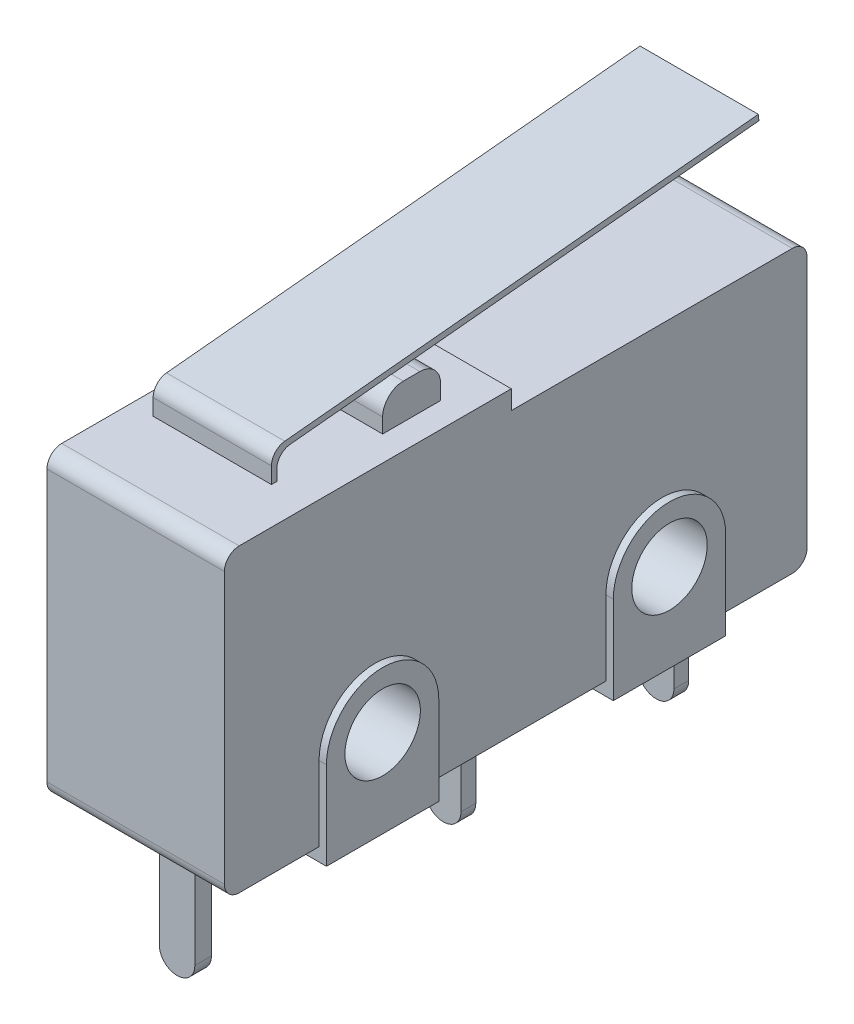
from build123d import *

# Parameters (mm, degrees)
SKETCH1_R           = 1.275
BOSS_EXTRUDE1_DEPTH = 6.5
SKETCH2_W           = 3.53
SKETCH2_H           = 1.96
BOSS_EXTRUDE2_DEPTH = 1.2
FILLET1_R           = 0.7
SKETCH3_W           = 3.2
SKETCH3_H           = 0.56
SKETCH3_H_2         = 0.5
BOSS_EXTRUDE3_DEPTH = 0.9
SKETCH4_W           = 1.2
SKETCH4_H           = 0.56
SKETCH4_H_2         = 0.5
BOSS_EXTRUDE4_DEPTH = 3.47
FILLET2_R           = 0.59
EXTRUDE_START       = -1.5
EXTRUDE_1_DEPTH     = 4
FILLET_1_R          = 0.5
EXTRUDE1_START      = -0.25
EXTRUDE1_DEPTH      = 0.25
EXTRUDE2_START      = -6.5
EXTRUDE2_DEPTH      = 0.25


with BuildPart() as part:
    # Sketch1 → Boss-Extrude1 (new body)
    with BuildSketch(Plane(origin=(0, 0, 0), x_dir=(0, 0, -1), z_dir=(1, 0, 0))):
        with BuildLine():
            Line((-37.373122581, 0), (-34.673122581, 0))
            Line((-34.673122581, 0), (-34.673122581, -0.45))
            Line((-34.673122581, -0.45), (-30.873122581, -0.45))
            Line((-30.873122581, -0.45), (-30.873122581, 0))
            Line((-30.873122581, 0), (-24.973122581, 0))
            Line((-24.973122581, 0), (-24.973122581, -0.45))
            Line((-24.973122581, -0.45), (-21.173122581, -0.45))
            Line((-21.173122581, -0.45), (-21.173122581, 0))
            Line((-21.173122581, 0), (-18.673122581, 0))
            ThreePointArc((-18.673122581, 0), (-18.31956919, 0.146446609), (-18.173122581, 0.5))
            Line((-18.173122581, 0.5), (-18.173122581, 9.02))
            ThreePointArc((-18.173122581, 9.02), (-18.31956919, 9.373553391), (-18.673122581, 9.52))
            Line((-18.673122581, 9.52), (-28.173122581, 9.52))
            Line((-28.173122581, 9.52), (-28.173122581, 10.16))
            Line((-28.173122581, 10.16), (-37.373122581, 10.16))
            ThreePointArc((-37.373122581, 10.16), (-37.726675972, 10.013553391), (-37.873122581, 9.66))
            Line((-37.873122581, 9.66), (-37.873122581, 0.5))
            ThreePointArc((-37.873122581, 0.5), (-37.726675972, 0.146446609), (-37.373122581, 0))
        make_face()
        with Locations(Location((-32.773122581, 2.525, 0), (0, 0, 180))):
            Circle(SKETCH1_R, mode=Mode.SUBTRACT)
        with Locations(Location((-23.073122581, 2.525, 0), (0, 0, 180))):
            Circle(SKETCH1_R, mode=Mode.SUBTRACT)
    extrude(amount=BOSS_EXTRUDE1_DEPTH)

    # Sketch2 → Boss-Extrude2 (add)
    with BuildSketch(Plane(origin=(0, 10.16, 0), x_dir=(1, 0, 0), z_dir=(0, 1, 0))):
        with Locations((3.635, -30.693122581)):
            Rectangle(SKETCH2_W, SKETCH2_H)
    extrude(amount=BOSS_EXTRUDE2_DEPTH)

    # Fillet1
    fillet1_edges = [part.edges().sort_by_distance(p)[0] for p in [
        (3.635, 11.36, 31.673122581),
        (3.635, 11.36, 29.713122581),
    ]]
    fillet(fillet1_edges, radius=FILLET1_R)

    # Sketch3 → Boss-Extrude3 (add)
    with BuildSketch(Plane(origin=(0, 0, 0), x_dir=(-1, 0, 0), z_dir=(0, -1, 0))):
        with Locations((-3.25, -36.193122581)):
            Rectangle(SKETCH3_W, SKETCH3_H)
        with Locations((-3.25, -27.223122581)):
            Rectangle(SKETCH3_W, SKETCH3_H_2)
        with Locations((-3.25, -20.023122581)):
            Rectangle(SKETCH3_W, SKETCH3_H_2)
    extrude(amount=BOSS_EXTRUDE3_DEPTH)

    # Sketch4 → Boss-Extrude4 (add)
    with BuildSketch(Plane(origin=(0, -0.9, 0), x_dir=(-1, 0, 0), z_dir=(0, -1, 0))):
        with Locations((-3.25, -36.193122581)):
            Rectangle(SKETCH4_W, SKETCH4_H)
        with Locations((-3.25, -27.223122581)):
            Rectangle(SKETCH4_W, SKETCH4_H_2)
        with Locations((-3.25, -20.023122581)):
            Rectangle(SKETCH4_W, SKETCH4_H_2)
    extrude(amount=BOSS_EXTRUDE4_DEPTH)

    # Fillet2
    fillet2_edges = [part.edges().sort_by_distance(p)[0] for p in [
        (2.65, -4.37, 36.193122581),
        (3.85, -4.37, 36.193122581),
        (2.65, -4.37, 27.223122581),
        (3.85, -4.37, 27.223122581),
        (3.85, -4.37, 20.023122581),
        (2.65, -4.37, 20.023122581),
    ]]
    fillet(fillet2_edges, radius=FILLET2_R)

    # Sketch 1 → Extrude 1 (add)
    with BuildSketch(Plane(origin=(6.5, 0, 0), x_dir=(0, 0, -1), z_dir=(1, 0, 0)).offset(EXTRUDE_START)):
        Polygon((-35.033122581, 10.16), (-34.851945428, 10.16), (-34.851945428, 10.976764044), (-18.550578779, 12.570949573), (-18.570044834, 12.77), (-35.033122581, 11.16), align=None)
    extrude(amount=-EXTRUDE_1_DEPTH)

    # Fillet 1
    fillet_1_edges = [part.edges().sort_by_distance(p)[0] for p in [
        (3, 11.16, 35.033122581),
        (3, 10.976764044, 34.851945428),
    ]]
    fillet(fillet_1_edges, radius=FILLET_1_R)

    # Sketch6 → Extrude1 (cut)
    with BuildSketch(Plane(origin=(6.5, 0, 0), x_dir=(0, 0, -1), z_dir=(1, 0, 0)).offset(EXTRUDE1_START)):
        with BuildLine():
            Line((-34.673122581, 0), (-34.673122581, 2.525))
            ThreePointArc((-34.673122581, 2.525), (-32.773122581, 4.425), (-30.873122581, 2.525))
            Line((-30.873122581, 2.525), (-30.873122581, 0))
            Line((-30.873122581, 0), (-24.973122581, 0))
            Line((-24.973122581, 0), (-24.973122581, 2.525))
            ThreePointArc((-24.973122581, 2.525), (-23.073122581, 4.425), (-21.173122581, 2.525))
            Line((-21.173122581, 2.525), (-21.173122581, 0))
            Line((-21.173122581, 0), (-18.673122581, 0))
            ThreePointArc((-18.673122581, 0), (-18.31956919, 0.146446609), (-18.173122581, 0.5))
            Line((-18.173122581, 0.5), (-18.173122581, 9.02))
            ThreePointArc((-18.173122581, 9.02), (-18.31956919, 9.373553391), (-18.673122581, 9.52))
            Line((-18.673122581, 9.52), (-28.173122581, 9.52))
            Line((-28.173122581, 9.52), (-28.173122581, 10.16))
            Line((-28.173122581, 10.16), (-37.373122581, 10.16))
            ThreePointArc((-37.373122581, 10.16), (-37.726675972, 10.013553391), (-37.873122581, 9.66))
            Line((-37.873122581, 9.66), (-37.873122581, 0.5))
            ThreePointArc((-37.873122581, 0.5), (-37.726675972, 0.146446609), (-37.373122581, 0))
            Line((-37.373122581, 0), (-34.673122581, 0))
        make_face()
    extrude(amount=EXTRUDE1_DEPTH, mode=Mode.SUBTRACT)

    # Sketch → Extrude2 (cut)
    with BuildSketch(Plane(origin=(6.5, 0, 0), x_dir=(0, 0, -1), z_dir=(1, 0, 0)).offset(EXTRUDE2_START)):
        with BuildLine():
            Line((-34.673122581, 0), (-34.673122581, 2.525))
            ThreePointArc((-34.673122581, 2.525), (-32.773122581, 4.425), (-30.873122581, 2.525))
            Line((-30.873122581, 2.525), (-30.873122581, 0))
            Line((-30.873122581, 0), (-24.973122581, 0))
            Line((-24.973122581, 0), (-24.973122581, 2.525))
            ThreePointArc((-24.973122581, 2.525), (-23.073122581, 4.425), (-21.173122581, 2.525))
            Line((-21.173122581, 2.525), (-21.173122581, 0))
            Line((-21.173122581, 0), (-18.673122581, 0))
            ThreePointArc((-18.673122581, 0), (-18.31956919, 0.146446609), (-18.173122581, 0.5))
            Line((-18.173122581, 0.5), (-18.173122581, 9.02))
            ThreePointArc((-18.173122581, 9.02), (-18.31956919, 9.373553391), (-18.673122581, 9.52))
            Line((-18.673122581, 9.52), (-28.173122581, 9.52))
            Line((-28.173122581, 9.52), (-28.173122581, 10.16))
            Line((-28.173122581, 10.16), (-37.373122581, 10.16))
            ThreePointArc((-37.373122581, 10.16), (-37.726675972, 10.013553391), (-37.873122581, 9.66))
            Line((-37.873122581, 9.66), (-37.873122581, 0.5))
            ThreePointArc((-37.873122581, 0.5), (-37.726675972, 0.146446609), (-37.373122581, 0))
            Line((-37.373122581, 0), (-34.673122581, 0))
        make_face()
    extrude(amount=EXTRUDE2_DEPTH, mode=Mode.SUBTRACT)


solid = part.part
